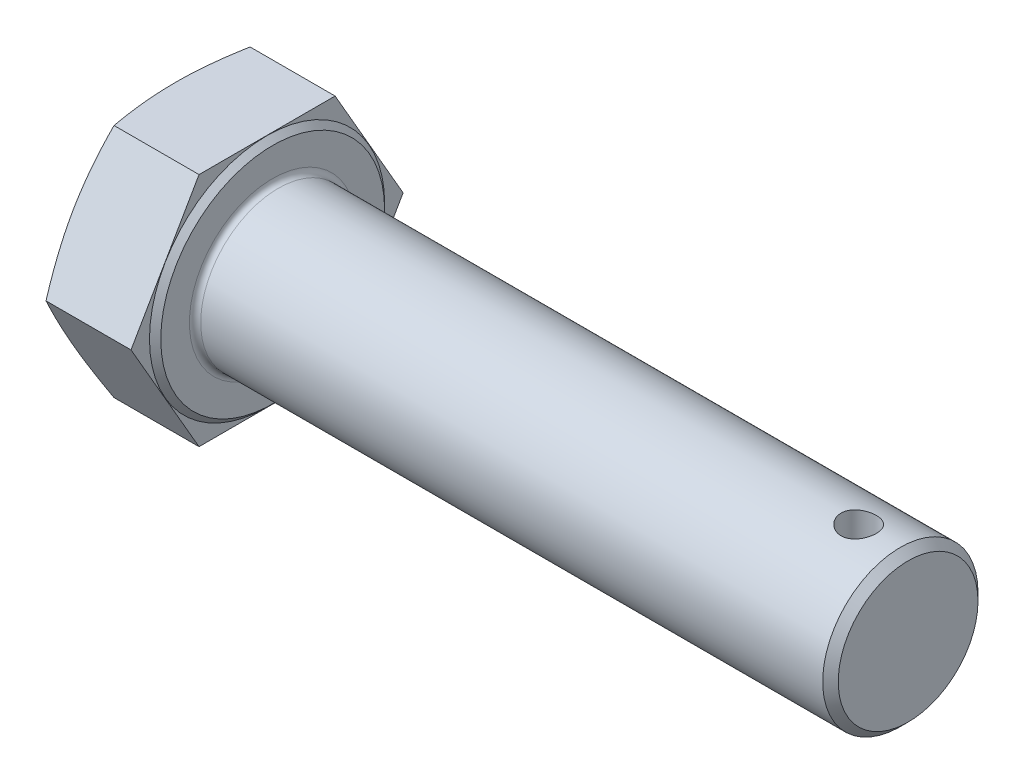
ISO-10303-21;
HEADER;
FILE_DESCRIPTION(('STEP AP214'),'2;1');
FILE_NAME('part.step','',(''),(''),'','','');
FILE_SCHEMA(('AUTOMOTIVE_DESIGN { 1 0 10303 214 1 1 1 1 }'));
ENDSEC;
DATA;
#1=APPLICATION_CONTEXT('core data for automotive mechanical design processes');
#2=APPLICATION_PROTOCOL_DEFINITION('international standard','automotive_design',2000,#1);
#3=PRODUCT_CONTEXT('',#1,'mechanical');
#4=PRODUCT('Part','Part','',(#3));
#5=PRODUCT_RELATED_PRODUCT_CATEGORY('part','',(#4));
#6=PRODUCT_DEFINITION_FORMATION('','',#4);
#7=PRODUCT_DEFINITION_CONTEXT('part definition',#1,'design');
#8=PRODUCT_DEFINITION('design','',#6,#7);
#9=PRODUCT_DEFINITION_SHAPE('','',#8);
#10=(LENGTH_UNIT() NAMED_UNIT(*) SI_UNIT(.MILLI.,.METRE.));
#11=(NAMED_UNIT(*) PLANE_ANGLE_UNIT() SI_UNIT($,.RADIAN.));
#12=(NAMED_UNIT(*) SI_UNIT($,.STERADIAN.) SOLID_ANGLE_UNIT());
#13=UNCERTAINTY_MEASURE_WITH_UNIT(LENGTH_MEASURE(1.E-05),#10,'distance_accuracy_value','');
#14=(GEOMETRIC_REPRESENTATION_CONTEXT(3) GLOBAL_UNCERTAINTY_ASSIGNED_CONTEXT((#13)) GLOBAL_UNIT_ASSIGNED_CONTEXT((#10,
#11,#12)) REPRESENTATION_CONTEXT('',''));
#15=CARTESIAN_POINT('',(0.,0.,0.));
#16=DIRECTION('',(0.,0.,1.));
#17=DIRECTION('',(1.,0.,0.));
#18=AXIS2_PLACEMENT_3D('',#15,#16,#17);
#19=CARTESIAN_POINT('',(13.78,0.,-19.2719519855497));
#20=DIRECTION('',(1.,0.,0.));
#21=DIRECTION('',(0.,0.,-1.));
#22=AXIS2_PLACEMENT_3D('',#19,#20,#21);
#23=PLANE('',#22);
#24=CARTESIAN_POINT('',(13.78,0.,0.));
#25=DIRECTION('',(1.,0.,0.));
#26=DIRECTION('',(0.,0.,-1.));
#27=AXIS2_PLACEMENT_3D('',#24,#25,#26);
#28=CIRCLE('',#27,11.8);
#29=CARTESIAN_POINT('',(13.78,0.,-11.8));
#30=VERTEX_POINT('',#29);
#31=EDGE_CURVE('E11',#30,#30,#28,.F.);
#32=ORIENTED_EDGE('',*,*,#31,.T.);
#33=EDGE_LOOP('',(#32));
#34=FACE_BOUND('',#33,.T.);
#35=CARTESIAN_POINT('',(13.78,0.,0.));
#36=DIRECTION('',(-1.,0.,0.));
#37=DIRECTION('',(0.,0.,1.));
#38=AXIS2_PLACEMENT_3D('',#35,#36,#37);
#39=CIRCLE('',#38,15.855);
#40=CARTESIAN_POINT('',(13.78,0.,15.855));
#41=VERTEX_POINT('',#40);
#42=EDGE_CURVE('E381',#41,#41,#39,.T.);
#43=ORIENTED_EDGE('',*,*,#42,.F.);
#44=EDGE_LOOP('',(#43));
#45=FACE_BOUND('',#44,.T.);
#46=ADVANCED_FACE('F32',(#34,#45),#23,.T.);
#47=CARTESIAN_POINT('',(13.78,-16.69,-9.63597599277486));
#48=DIRECTION('',(0.,0.5,0.866025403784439));
#49=DIRECTION('',(0.,-0.866025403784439,0.5));
#50=AXIS2_PLACEMENT_3D('',#47,#48,#49);
#51=PLANE('',#50);
#52=CARTESIAN_POINT('',(0.939795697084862,0.000200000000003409,-19.2720674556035));
#53=CARTESIAN_POINT('',(0.867168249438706,-0.345441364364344,-19.0725113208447));
#54=CARTESIAN_POINT('',(0.797807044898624,-0.691590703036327,-18.8726619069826));
#55=CARTESIAN_POINT('',(0.666335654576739,-1.38495249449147,-18.4723492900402));
#56=CARTESIAN_POINT('',(0.604226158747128,-1.7321650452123,-18.2718860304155));
#57=CARTESIAN_POINT('',(0.429792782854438,-2.7758502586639,-17.66931409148));
#58=CARTESIAN_POINT('',(0.329466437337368,-3.47389266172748,-17.2662991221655));
#59=CARTESIAN_POINT('',(0.207537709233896,-4.52008028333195,-16.6622824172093));
#60=CARTESIAN_POINT('',(0.1717582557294,-4.86701845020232,-16.4619775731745));
#61=CARTESIAN_POINT('',(0.109969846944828,-5.56154255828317,-16.0609938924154));
#62=CARTESIAN_POINT('',(0.0839604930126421,-5.90912847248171,-15.8603150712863));
#63=CARTESIAN_POINT('',(0.0421666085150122,-6.60464256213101,-15.4587598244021));
#64=CARTESIAN_POINT('',(0.0263785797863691,-6.95257057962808,-15.2578834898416));
#65=CARTESIAN_POINT('',(0.00529529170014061,-7.64866573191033,-14.8559927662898));
#66=CARTESIAN_POINT('',(0.,-7.99683286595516,-14.6549783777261));
#67=CARTESIAN_POINT('',(0.,-8.69316713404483,-14.2529496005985));
#68=CARTESIAN_POINT('',(0.00529529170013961,-9.04133426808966,-14.0519352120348));
#69=CARTESIAN_POINT('',(0.0263785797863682,-9.73742942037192,-13.650044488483));
#70=CARTESIAN_POINT('',(0.0421666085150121,-10.085357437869,-13.4491681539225));
#71=CARTESIAN_POINT('',(0.0839604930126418,-10.7808715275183,-13.0476129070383));
#72=CARTESIAN_POINT('',(0.109969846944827,-11.1284574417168,-12.8469340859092));
#73=CARTESIAN_POINT('',(0.171758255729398,-11.8229815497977,-12.44595040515));
#74=CARTESIAN_POINT('',(0.207537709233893,-12.169919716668,-12.2456455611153));
#75=CARTESIAN_POINT('',(0.329466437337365,-13.2161073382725,-11.6416288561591));
#76=CARTESIAN_POINT('',(0.429792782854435,-13.9141497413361,-11.2386138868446));
#77=CARTESIAN_POINT('',(0.604226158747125,-14.9578349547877,-10.636041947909));
#78=CARTESIAN_POINT('',(0.666335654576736,-15.3050475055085,-10.4355786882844));
#79=CARTESIAN_POINT('',(0.797807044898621,-15.9984092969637,-10.0352660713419));
#80=CARTESIAN_POINT('',(0.867168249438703,-16.3445586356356,-9.83541665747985));
#81=CARTESIAN_POINT('',(0.93979569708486,-16.6902,-9.63586052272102));
#82=B_SPLINE_CURVE_WITH_KNOTS('',3,(#52,#53,#54,#55,#56,#57,#58,#59,#60,#61,#62,#63,#64,#65,#66,
#67,#68,#69,#70,#71,#72,#73,#74,#75,#76,#77,#78,#79,#80,#81),.UNSPECIFIED.,.F.,.F.,(4,2,2,2,2,2,
2,2,2,2,2,2,2,2,4),(0.,1.21696349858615,2.43404268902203,4.86988356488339,6.07640128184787,
7.28286976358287,8.4889251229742,9.69497676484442,10.9010284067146,12.107083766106,
13.313552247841,14.5200699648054,16.9559108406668,18.1729900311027,19.3899535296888),.UNSPECIFIED.);
#83=CARTESIAN_POINT('',(0.939753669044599,0.,-19.2719519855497));
#84=VERTEX_POINT('',#83);
#85=CARTESIAN_POINT('',(0.,-8.345,-14.4539639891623));
#86=VERTEX_POINT('',#85);
#87=EDGE_CURVE('E111',#84,#86,#82,.T.);
#88=ORIENTED_EDGE('',*,*,#87,.F.);
#89=DIRECTION('',(-1.,0.,0.));
#90=VECTOR('',#89,1.);
#91=CARTESIAN_POINT('',(13.78,0.,-19.2719519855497));
#92=LINE('',#91,#90);
#93=CARTESIAN_POINT('',(12.98,0.,-19.2719519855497));
#94=VERTEX_POINT('',#93);
#95=EDGE_CURVE('E140',#94,#84,#92,.T.);
#96=ORIENTED_EDGE('',*,*,#95,.F.);
#97=DIRECTION('',(0.,0.866025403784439,-0.5));
#98=VECTOR('',#97,1.);
#99=CARTESIAN_POINT('',(12.98,-16.69,-9.63597599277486));
#100=LINE('',#99,#98);
#101=CARTESIAN_POINT('',(12.98,-16.69,-9.63597599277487));
#102=VERTEX_POINT('',#101);
#103=EDGE_CURVE('E396',#102,#94,#100,.T.);
#104=ORIENTED_EDGE('',*,*,#103,.F.);
#105=DIRECTION('',(-1.,0.,0.));
#106=VECTOR('',#105,1.);
#107=CARTESIAN_POINT('',(13.78,-16.69,-9.63597599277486));
#108=LINE('',#107,#106);
#109=CARTESIAN_POINT('',(0.939753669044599,-16.69,-9.63597599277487));
#110=VERTEX_POINT('',#109);
#111=EDGE_CURVE('E134',#102,#110,#108,.T.);
#112=ORIENTED_EDGE('',*,*,#111,.T.);
#113=EDGE_CURVE('E234',#86,#110,#82,.T.);
#114=ORIENTED_EDGE('',*,*,#113,.F.);
#115=EDGE_LOOP('',(#88,#96,#104,#112,#114));
#116=FACE_BOUND('',#115,.T.);
#117=ADVANCED_FACE('F34',(#116),#51,.F.);
#118=CARTESIAN_POINT('',(13.78,0.,-19.2719519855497));
#119=DIRECTION('',(0.,-0.5,0.866025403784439));
#120=DIRECTION('',(0.,-0.866025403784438,-0.5));
#121=AXIS2_PLACEMENT_3D('',#118,#119,#120);
#122=PLANE('',#121);
#123=CARTESIAN_POINT('',(0.93979569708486,16.6902,-9.63586052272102));
#124=CARTESIAN_POINT('',(0.867168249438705,16.3445586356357,-9.83541665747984));
#125=CARTESIAN_POINT('',(0.797807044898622,15.9984092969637,-10.0352660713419));
#126=CARTESIAN_POINT('',(0.666335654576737,15.3050475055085,-10.4355786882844));
#127=CARTESIAN_POINT('',(0.604226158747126,14.9578349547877,-10.636041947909));
#128=CARTESIAN_POINT('',(0.429792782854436,13.9141497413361,-11.2386138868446));
#129=CARTESIAN_POINT('',(0.329466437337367,13.2161073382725,-11.6416288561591));
#130=CARTESIAN_POINT('',(0.207537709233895,12.169919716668,-12.2456455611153));
#131=CARTESIAN_POINT('',(0.171758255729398,11.8229815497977,-12.44595040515));
#132=CARTESIAN_POINT('',(0.109969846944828,11.1284574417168,-12.8469340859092));
#133=CARTESIAN_POINT('',(0.0839604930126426,10.7808715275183,-13.0476129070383));
#134=CARTESIAN_POINT('',(0.042166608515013,10.085357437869,-13.4491681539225));
#135=CARTESIAN_POINT('',(0.026378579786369,9.73742942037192,-13.650044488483));
#136=CARTESIAN_POINT('',(0.0052952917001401,9.04133426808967,-14.0519352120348));
#137=CARTESIAN_POINT('',(0.,8.69316713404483,-14.2529496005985));
#138=CARTESIAN_POINT('',(0.,7.99683286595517,-14.654978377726));
#139=CARTESIAN_POINT('',(0.00529529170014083,7.64866573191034,-14.8559927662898));
#140=CARTESIAN_POINT('',(0.0263785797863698,6.95257057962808,-15.2578834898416));
#141=CARTESIAN_POINT('',(0.0421666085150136,6.60464256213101,-15.4587598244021));
#142=CARTESIAN_POINT('',(0.0839604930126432,5.90912847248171,-15.8603150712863));
#143=CARTESIAN_POINT('',(0.109969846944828,5.56154255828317,-16.0609938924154));
#144=CARTESIAN_POINT('',(0.171758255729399,4.86701845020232,-16.4619775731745));
#145=CARTESIAN_POINT('',(0.207537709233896,4.52008028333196,-16.6622824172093));
#146=CARTESIAN_POINT('',(0.329466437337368,3.47389266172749,-17.2662991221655));
#147=CARTESIAN_POINT('',(0.429792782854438,2.77585025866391,-17.66931409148));
#148=CARTESIAN_POINT('',(0.604226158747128,1.73216504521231,-18.2718860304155));
#149=CARTESIAN_POINT('',(0.666335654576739,1.38495249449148,-18.4723492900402));
#150=CARTESIAN_POINT('',(0.797807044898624,0.691590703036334,-18.8726619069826));
#151=CARTESIAN_POINT('',(0.867168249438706,0.345441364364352,-19.0725113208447));
#152=CARTESIAN_POINT('',(0.939795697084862,-0.000199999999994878,-19.2720674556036));
#153=B_SPLINE_CURVE_WITH_KNOTS('',3,(#123,#124,#125,#126,#127,#128,#129,#130,#131,#132,#133,
#134,#135,#136,#137,#138,#139,#140,#141,#142,#143,#144,#145,#146,#147,#148,#149,#150,#151,#152),
.UNSPECIFIED.,.F.,.F.,(4,2,2,2,2,2,2,2,2,2,2,2,2,2,4),(0.,1.21696349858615,2.43404268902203,
4.86988356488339,6.07640128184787,7.28286976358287,8.4889251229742,9.69497676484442,
10.9010284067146,12.107083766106,13.313552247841,14.5200699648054,16.9559108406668,
18.1729900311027,19.3899535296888),.UNSPECIFIED.);
#154=CARTESIAN_POINT('',(0.939753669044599,16.69,-9.63597599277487));
#155=VERTEX_POINT('',#154);
#156=CARTESIAN_POINT('',(0.,8.34500000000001,-14.4539639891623));
#157=VERTEX_POINT('',#156);
#158=EDGE_CURVE('E245',#155,#157,#153,.T.);
#159=ORIENTED_EDGE('',*,*,#158,.F.);
#160=DIRECTION('',(-1.,0.,0.));
#161=VECTOR('',#160,1.);
#162=CARTESIAN_POINT('',(13.78,16.69,-9.63597599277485));
#163=LINE('',#162,#161);
#164=CARTESIAN_POINT('',(12.98,16.69,-9.63597599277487));
#165=VERTEX_POINT('',#164);
#166=EDGE_CURVE('E131',#165,#155,#163,.T.);
#167=ORIENTED_EDGE('',*,*,#166,.F.);
#168=DIRECTION('',(0.,0.866025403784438,0.5));
#169=VECTOR('',#168,1.);
#170=CARTESIAN_POINT('',(12.98,0.,-19.2719519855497));
#171=LINE('',#170,#169);
#172=EDGE_CURVE('E398',#94,#165,#171,.T.);
#173=ORIENTED_EDGE('',*,*,#172,.F.);
#174=ORIENTED_EDGE('',*,*,#95,.T.);
#175=EDGE_CURVE('E122',#157,#84,#153,.T.);
#176=ORIENTED_EDGE('',*,*,#175,.F.);
#177=EDGE_LOOP('',(#159,#167,#173,#174,#176));
#178=FACE_BOUND('',#177,.T.);
#179=ADVANCED_FACE('F195',(#178),#122,.F.);
#180=CARTESIAN_POINT('',(13.78,16.69,-9.63597599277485));
#181=DIRECTION('',(0.,-1.,0.));
#182=DIRECTION('',(0.,0.,-1.));
#183=AXIS2_PLACEMENT_3D('',#180,#181,#182);
#184=PLANE('',#183);
#185=CARTESIAN_POINT('',(5.02167092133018,16.69,-25.5126761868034));
#186=CARTESIAN_POINT('',(4.90667655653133,16.69,-25.135123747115));
#187=CARTESIAN_POINT('',(4.79237762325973,16.69,-24.7573596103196));
#188=CARTESIAN_POINT('',(4.56532630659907,16.69,-24.001364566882));
#189=CARTESIAN_POINT('',(4.45257393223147,16.69,-23.623133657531));
#190=CARTESIAN_POINT('',(4.11685563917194,16.69,-22.4876263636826));
#191=CARTESIAN_POINT('',(3.89644559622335,16.69,-21.7295912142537));
#192=CARTESIAN_POINT('',(3.46360774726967,16.69,-20.2097103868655));
#193=CARTESIAN_POINT('',(3.25119560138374,16.69,-19.4478602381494));
#194=CARTESIAN_POINT('',(2.83682211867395,16.69,-17.9213263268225));
#195=CARTESIAN_POINT('',(2.63486059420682,16.69,-17.1566426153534));
#196=CARTESIAN_POINT('',(2.24639209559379,16.69,-15.6333807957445));
#197=CARTESIAN_POINT('',(2.0597252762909,16.69,-14.8748436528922));
#198=CARTESIAN_POINT('',(1.70228382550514,16.69,-13.3539948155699));
#199=CARTESIAN_POINT('',(1.53150946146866,16.69,-12.5916830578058));
#200=CARTESIAN_POINT('',(1.20983471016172,16.69,-11.0631143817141));
#201=CARTESIAN_POINT('',(1.05892754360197,16.69,-10.2968589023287));
#202=CARTESIAN_POINT('',(0.781582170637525,16.69,-8.75989930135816));
#203=CARTESIAN_POINT('',(0.655143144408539,16.69,-7.98919532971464));
#204=CARTESIAN_POINT('',(0.444389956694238,16.69,-6.53012303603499));
#205=CARTESIAN_POINT('',(0.356942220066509,16.69,-5.84221159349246));
#206=CARTESIAN_POINT('',(0.208914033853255,16.69,-4.46347987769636));
#207=CARTESIAN_POINT('',(0.14833280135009,16.69,-3.77265968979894));
#208=CARTESIAN_POINT('',(0.0569550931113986,16.69,-2.38951172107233));
#209=CARTESIAN_POINT('',(0.0261375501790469,16.69,-1.69718535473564));
#210=CARTESIAN_POINT('',(-0.004152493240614,16.69,-0.311839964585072));
#211=CARTESIAN_POINT('',(-0.00362521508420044,16.69,0.381179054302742));
#212=CARTESIAN_POINT('',(0.0288278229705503,16.69,1.76998588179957));
#213=CARTESIAN_POINT('',(0.060912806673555,16.69,2.46576990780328));
#214=CARTESIAN_POINT('',(0.155004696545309,16.69,3.85529426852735));
#215=CARTESIAN_POINT('',(0.217012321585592,16.69,4.54903455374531));
#216=CARTESIAN_POINT('',(0.368048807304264,16.69,5.93412887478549));
#217=CARTESIAN_POINT('',(0.457100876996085,16.69,6.62548034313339));
#218=CARTESIAN_POINT('',(0.658614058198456,16.69,8.00472461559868));
#219=CARTESIAN_POINT('',(0.771075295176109,16.69,8.69261740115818));
#220=CARTESIAN_POINT('',(1.02221809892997,16.69,10.1011424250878));
#221=CARTESIAN_POINT('',(1.16197193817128,16.69,10.8215817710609));
#222=CARTESIAN_POINT('',(1.45946676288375,16.69,12.2587608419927));
#223=CARTESIAN_POINT('',(1.61720910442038,16.69,12.9755002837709));
#224=CARTESIAN_POINT('',(1.94736866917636,16.69,14.4057902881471));
#225=CARTESIAN_POINT('',(2.11979015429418,16.69,15.1193398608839));
#226=CARTESIAN_POINT('',(2.47650321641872,16.69,16.5434331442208));
#227=CARTESIAN_POINT('',(2.66079450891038,16.69,17.2539769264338));
#228=CARTESIAN_POINT('',(3.03927131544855,16.69,18.6733925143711));
#229=CARTESIAN_POINT('',(3.23346923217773,16.69,19.3822610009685));
#230=CARTESIAN_POINT('',(3.62976485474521,16.69,20.797783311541));
#231=CARTESIAN_POINT('',(3.83186259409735,16.69,21.504437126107));
#232=CARTESIAN_POINT('',(4.2425118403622,16.69,22.9157343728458));
#233=CARTESIAN_POINT('',(4.45106225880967,16.69,23.620378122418));
#234=CARTESIAN_POINT('',(4.87352836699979,16.69,25.0280510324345));
#235=CARTESIAN_POINT('',(5.08744404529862,16.69,25.7310801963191));
#236=CARTESIAN_POINT('',(5.5173589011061,16.69,27.1280057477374));
#237=CARTESIAN_POINT('',(5.73330899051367,16.69,27.8219172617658));
#238=CARTESIAN_POINT('',(6.16889244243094,16.69,29.2085840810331));
#239=CARTESIAN_POINT('',(6.38852581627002,16.69,29.9013393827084));
#240=CARTESIAN_POINT('',(7.05209604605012,16.69,31.9781794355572));
#241=CARTESIAN_POINT('',(7.50068453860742,16.69,33.3607786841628));
#242=CARTESIAN_POINT('',(8.17950228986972,16.69,35.4298173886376));
#243=CARTESIAN_POINT('',(8.40632573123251,16.69,36.1173799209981));
#244=CARTESIAN_POINT('',(8.86193435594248,16.69,37.4918557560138));
#245=CARTESIAN_POINT('',(9.09071954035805,16.69,38.1787690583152));
#246=CARTESIAN_POINT('',(9.54996937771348,16.69,39.5519709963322));
#247=CARTESIAN_POINT('',(9.78043389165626,16.69,40.2382596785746));
#248=CARTESIAN_POINT('',(10.2428541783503,16.69,41.6103326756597));
#249=CARTESIAN_POINT('',(10.4748099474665,16.69,42.2961169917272));
#250=CARTESIAN_POINT('',(10.7074085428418,16.69,42.9816827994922));
#251=B_SPLINE_CURVE_WITH_KNOTS('',3,(#185,#186,#187,#188,#189,#190,#191,#192,#193,#194,#195,
#196,#197,#198,#199,#200,#201,#202,#203,#204,#205,#206,#207,#208,#209,#210,#211,#212,#213,#214,
#215,#216,#217,#218,#219,#220,#221,#222,#223,#224,#225,#226,#227,#228,#229,#230,#231,#232,#233,
#234,#235,#236,#237,#238,#239,#240,#241,#242,#243,#244,#245,#246,#247,#248,#249,#250),
.UNSPECIFIED.,.F.,.F.,(4,2,2,2,2,2,2,2,2,2,2,2,2,2,2,2,2,2,2,2,2,2,2,2,2,2,2,2,2,2,2,2,4),(0.,
1.18402827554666,2.36806345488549,4.7363088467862,7.10897279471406,9.48159412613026,
11.8249622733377,14.1683698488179,16.5109756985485,18.8535030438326,20.9333884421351,
23.0132132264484,25.0915647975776,27.1699016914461,29.2587788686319,31.3477062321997,
33.4384313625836,35.5291676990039,37.7304937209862,39.9319858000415,42.134119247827,
44.3361999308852,46.5411086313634,48.746026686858,50.9505748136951,53.1551182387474,
55.335319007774,57.5155264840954,61.8761287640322,64.0481587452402,66.2201899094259,
68.3920432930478,70.5638913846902),.UNSPECIFIED.);
#252=CARTESIAN_POINT('',(0.939753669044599,16.69,9.63597599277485));
#253=VERTEX_POINT('',#252);
#254=CARTESIAN_POINT('',(0.,16.69,0.));
#255=VERTEX_POINT('',#254);
#256=EDGE_CURVE('E48',#253,#255,#251,.F.);
#257=ORIENTED_EDGE('',*,*,#256,.F.);
#258=DIRECTION('',(-1.,0.,0.));
#259=VECTOR('',#258,1.);
#260=CARTESIAN_POINT('',(13.78,16.69,9.63597599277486));
#261=LINE('',#260,#259);
#262=CARTESIAN_POINT('',(12.98,16.69,9.63597599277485));
#263=VERTEX_POINT('',#262);
#264=EDGE_CURVE('E128',#263,#253,#261,.T.);
#265=ORIENTED_EDGE('',*,*,#264,.F.);
#266=DIRECTION('',(0.,0.,1.));
#267=VECTOR('',#266,1.);
#268=CARTESIAN_POINT('',(12.98,16.69,-9.63597599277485));
#269=LINE('',#268,#267);
#270=EDGE_CURVE('E400',#165,#263,#269,.T.);
#271=ORIENTED_EDGE('',*,*,#270,.F.);
#272=ORIENTED_EDGE('',*,*,#166,.T.);
#273=EDGE_CURVE('E246',#255,#155,#251,.F.);
#274=ORIENTED_EDGE('',*,*,#273,.F.);
#275=EDGE_LOOP('',(#257,#265,#271,#272,#274));
#276=FACE_BOUND('',#275,.T.);
#277=ADVANCED_FACE('F254',(#276),#184,.F.);
#278=CARTESIAN_POINT('',(13.78,16.69,9.63597599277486));
#279=DIRECTION('',(0.,-0.5,-0.866025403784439));
#280=DIRECTION('',(0.,0.866025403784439,-0.5));
#281=AXIS2_PLACEMENT_3D('',#278,#279,#280);
#282=PLANE('',#281);
#283=CARTESIAN_POINT('',(0.939795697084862,-0.0001999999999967,19.2720674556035));
#284=CARTESIAN_POINT('',(0.867168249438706,0.345441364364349,19.0725113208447));
#285=CARTESIAN_POINT('',(0.797807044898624,0.691590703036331,18.8726619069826));
#286=CARTESIAN_POINT('',(0.666335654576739,1.38495249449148,18.4723492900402));
#287=CARTESIAN_POINT('',(0.604226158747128,1.73216504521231,18.2718860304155));
#288=CARTESIAN_POINT('',(0.429792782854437,2.77585025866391,17.66931409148));
#289=CARTESIAN_POINT('',(0.329466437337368,3.47389266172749,17.2662991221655));
#290=CARTESIAN_POINT('',(0.207537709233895,4.52008028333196,16.6622824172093));
#291=CARTESIAN_POINT('',(0.171758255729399,4.86701845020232,16.4619775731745));
#292=CARTESIAN_POINT('',(0.109969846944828,5.56154255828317,16.0609938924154));
#293=CARTESIAN_POINT('',(0.0839604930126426,5.90912847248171,15.8603150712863));
#294=CARTESIAN_POINT('',(0.042166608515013,6.60464256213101,15.4587598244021));
#295=CARTESIAN_POINT('',(0.0263785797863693,6.95257057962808,15.2578834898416));
#296=CARTESIAN_POINT('',(0.00529529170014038,7.64866573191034,14.8559927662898));
#297=CARTESIAN_POINT('',(0.,7.99683286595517,14.654978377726));
#298=CARTESIAN_POINT('',(0.,8.69316713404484,14.2529496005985));
#299=CARTESIAN_POINT('',(0.00529529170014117,9.04133426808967,14.0519352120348));
#300=CARTESIAN_POINT('',(0.0263785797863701,9.73742942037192,13.650044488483));
#301=CARTESIAN_POINT('',(0.0421666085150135,10.085357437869,13.4491681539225));
#302=CARTESIAN_POINT('',(0.0839604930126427,10.7808715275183,13.0476129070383));
#303=CARTESIAN_POINT('',(0.109969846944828,11.1284574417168,12.8469340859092));
#304=CARTESIAN_POINT('',(0.171758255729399,11.8229815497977,12.44595040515));
#305=CARTESIAN_POINT('',(0.207537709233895,12.1699197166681,12.2456455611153));
#306=CARTESIAN_POINT('',(0.329466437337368,13.2161073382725,11.6416288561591));
#307=CARTESIAN_POINT('',(0.429792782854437,13.9141497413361,11.2386138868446));
#308=CARTESIAN_POINT('',(0.604226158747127,14.9578349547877,10.636041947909));
#309=CARTESIAN_POINT('',(0.666335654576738,15.3050475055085,10.4355786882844));
#310=CARTESIAN_POINT('',(0.797807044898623,15.9984092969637,10.0352660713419));
#311=CARTESIAN_POINT('',(0.867168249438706,16.3445586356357,9.83541665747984));
#312=CARTESIAN_POINT('',(0.939795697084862,16.6902,9.63586052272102));
#313=B_SPLINE_CURVE_WITH_KNOTS('',3,(#283,#284,#285,#286,#287,#288,#289,#290,#291,#292,#293,
#294,#295,#296,#297,#298,#299,#300,#301,#302,#303,#304,#305,#306,#307,#308,#309,#310,#311,#312),
.UNSPECIFIED.,.F.,.F.,(4,2,2,2,2,2,2,2,2,2,2,2,2,2,4),(0.,1.21696349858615,2.43404268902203,
4.86988356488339,6.07640128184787,7.28286976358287,8.4889251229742,9.69497676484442,
10.9010284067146,12.107083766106,13.313552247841,14.5200699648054,16.9559108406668,
18.1729900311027,19.3899535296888),.UNSPECIFIED.);
#314=CARTESIAN_POINT('',(0.939753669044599,0.,19.2719519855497));
#315=VERTEX_POINT('',#314);
#316=CARTESIAN_POINT('',(0.,8.345,14.4539639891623));
#317=VERTEX_POINT('',#316);
#318=EDGE_CURVE('E56',#315,#317,#313,.T.);
#319=ORIENTED_EDGE('',*,*,#318,.F.);
#320=DIRECTION('',(-1.,0.,0.));
#321=VECTOR('',#320,1.);
#322=CARTESIAN_POINT('',(13.78,0.,19.2719519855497));
#323=LINE('',#322,#321);
#324=CARTESIAN_POINT('',(12.98,0.,19.2719519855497));
#325=VERTEX_POINT('',#324);
#326=EDGE_CURVE('E119',#325,#315,#323,.T.);
#327=ORIENTED_EDGE('',*,*,#326,.F.);
#328=DIRECTION('',(0.,-0.866025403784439,0.5));
#329=VECTOR('',#328,1.);
#330=CARTESIAN_POINT('',(12.98,16.69,9.63597599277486));
#331=LINE('',#330,#329);
#332=EDGE_CURVE('E404',#263,#325,#331,.T.);
#333=ORIENTED_EDGE('',*,*,#332,.F.);
#334=ORIENTED_EDGE('',*,*,#264,.T.);
#335=EDGE_CURVE('E121',#317,#253,#313,.T.);
#336=ORIENTED_EDGE('',*,*,#335,.F.);
#337=EDGE_LOOP('',(#319,#327,#333,#334,#336));
#338=FACE_BOUND('',#337,.T.);
#339=ADVANCED_FACE('F117',(#338),#282,.F.);
#340=CARTESIAN_POINT('',(13.78,0.,19.2719519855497));
#341=DIRECTION('',(0.,0.5,-0.866025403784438));
#342=DIRECTION('',(0.,0.866025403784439,0.5));
#343=AXIS2_PLACEMENT_3D('',#340,#341,#342);
#344=PLANE('',#343);
#345=CARTESIAN_POINT('',(0.939795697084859,-16.6902,9.63586052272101));
#346=CARTESIAN_POINT('',(0.867168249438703,-16.3445586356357,9.83541665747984));
#347=CARTESIAN_POINT('',(0.797807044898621,-15.9984092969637,10.0352660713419));
#348=CARTESIAN_POINT('',(0.666335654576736,-15.3050475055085,10.4355786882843));
#349=CARTESIAN_POINT('',(0.604226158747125,-14.9578349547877,10.636041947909));
#350=CARTESIAN_POINT('',(0.429792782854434,-13.9141497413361,11.2386138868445));
#351=CARTESIAN_POINT('',(0.329466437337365,-13.2161073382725,11.6416288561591));
#352=CARTESIAN_POINT('',(0.207537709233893,-12.169919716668,12.2456455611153));
#353=CARTESIAN_POINT('',(0.171758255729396,-11.8229815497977,12.44595040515));
#354=CARTESIAN_POINT('',(0.109969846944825,-11.1284574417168,12.8469340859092));
#355=CARTESIAN_POINT('',(0.0839604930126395,-10.7808715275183,13.0476129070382));
#356=CARTESIAN_POINT('',(0.0421666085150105,-10.085357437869,13.4491681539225));
#357=CARTESIAN_POINT('',(0.0263785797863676,-9.73742942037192,13.650044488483));
#358=CARTESIAN_POINT('',(0.00529529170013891,-9.04133426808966,14.0519352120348));
#359=CARTESIAN_POINT('',(0.,-8.69316713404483,14.2529496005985));
#360=CARTESIAN_POINT('',(0.,-7.99683286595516,14.654978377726));
#361=CARTESIAN_POINT('',(0.00529529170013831,-7.64866573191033,14.8559927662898));
#362=CARTESIAN_POINT('',(0.0263785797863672,-6.95257057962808,15.2578834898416));
#363=CARTESIAN_POINT('',(0.0421666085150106,-6.60464256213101,15.4587598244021));
#364=CARTESIAN_POINT('',(0.0839604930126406,-5.90912847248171,15.8603150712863));
#365=CARTESIAN_POINT('',(0.109969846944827,-5.56154255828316,16.0609938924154));
#366=CARTESIAN_POINT('',(0.171758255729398,-4.86701845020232,16.4619775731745));
#367=CARTESIAN_POINT('',(0.207537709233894,-4.52008028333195,16.6622824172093));
#368=CARTESIAN_POINT('',(0.329466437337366,-3.47389266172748,17.2662991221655));
#369=CARTESIAN_POINT('',(0.429792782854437,-2.7758502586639,17.66931409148));
#370=CARTESIAN_POINT('',(0.604226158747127,-1.7321650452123,18.2718860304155));
#371=CARTESIAN_POINT('',(0.666335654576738,-1.38495249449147,18.4723492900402));
#372=CARTESIAN_POINT('',(0.797807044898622,-0.691590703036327,18.8726619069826));
#373=CARTESIAN_POINT('',(0.867168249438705,-0.345441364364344,19.0725113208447));
#374=CARTESIAN_POINT('',(0.939795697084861,0.000200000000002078,19.2720674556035));
#375=B_SPLINE_CURVE_WITH_KNOTS('',3,(#345,#346,#347,#348,#349,#350,#351,#352,#353,#354,#355,
#356,#357,#358,#359,#360,#361,#362,#363,#364,#365,#366,#367,#368,#369,#370,#371,#372,#373,#374),
.UNSPECIFIED.,.F.,.F.,(4,2,2,2,2,2,2,2,2,2,2,2,2,2,4),(0.,1.21696349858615,2.43404268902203,
4.86988356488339,6.07640128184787,7.28286976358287,8.4889251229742,9.69497676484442,
10.9010284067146,12.107083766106,13.313552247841,14.5200699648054,16.9559108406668,
18.1729900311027,19.3899535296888),.UNSPECIFIED.);
#376=CARTESIAN_POINT('',(0.939753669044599,-16.69,9.63597599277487));
#377=VERTEX_POINT('',#376);
#378=CARTESIAN_POINT('',(0.,-8.34500000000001,14.4539639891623));
#379=VERTEX_POINT('',#378);
#380=EDGE_CURVE('E113',#377,#379,#375,.T.);
#381=ORIENTED_EDGE('',*,*,#380,.F.);
#382=DIRECTION('',(-1.,0.,0.));
#383=VECTOR('',#382,1.);
#384=CARTESIAN_POINT('',(13.78,-16.69,9.63597599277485));
#385=LINE('',#384,#383);
#386=CARTESIAN_POINT('',(12.98,-16.69,9.63597599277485));
#387=VERTEX_POINT('',#386);
#388=EDGE_CURVE('E129',#387,#377,#385,.T.);
#389=ORIENTED_EDGE('',*,*,#388,.F.);
#390=DIRECTION('',(0.,-0.866025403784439,-0.5));
#391=VECTOR('',#390,1.);
#392=CARTESIAN_POINT('',(12.98,0.,19.2719519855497));
#393=LINE('',#392,#391);
#394=EDGE_CURVE('E127',#325,#387,#393,.T.);
#395=ORIENTED_EDGE('',*,*,#394,.F.);
#396=ORIENTED_EDGE('',*,*,#326,.T.);
#397=EDGE_CURVE('E103',#379,#315,#375,.T.);
#398=ORIENTED_EDGE('',*,*,#397,.F.);
#399=EDGE_LOOP('',(#381,#389,#395,#396,#398));
#400=FACE_BOUND('',#399,.T.);
#401=ADVANCED_FACE('F125',(#400),#344,.F.);
#402=CARTESIAN_POINT('',(13.78,-16.69,9.63597599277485));
#403=DIRECTION('',(0.,1.,0.));
#404=DIRECTION('',(0.,0.,1.));
#405=AXIS2_PLACEMENT_3D('',#402,#403,#404);
#406=PLANE('',#405);
#407=CARTESIAN_POINT('',(5.02167092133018,-16.69,-25.5126761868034));
#408=CARTESIAN_POINT('',(4.90667655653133,-16.69,-25.135123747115));
#409=CARTESIAN_POINT('',(4.79237762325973,-16.69,-24.7573596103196));
#410=CARTESIAN_POINT('',(4.56532630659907,-16.69,-24.0013645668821));
#411=CARTESIAN_POINT('',(4.45257393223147,-16.69,-23.623133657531));
#412=CARTESIAN_POINT('',(4.11685563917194,-16.69,-22.4876263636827));
#413=CARTESIAN_POINT('',(3.89644559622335,-16.69,-21.7295912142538));
#414=CARTESIAN_POINT('',(3.46360774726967,-16.69,-20.2097103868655));
#415=CARTESIAN_POINT('',(3.25119560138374,-16.69,-19.4478602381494));
#416=CARTESIAN_POINT('',(2.83682211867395,-16.69,-17.9213263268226));
#417=CARTESIAN_POINT('',(2.63486059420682,-16.69,-17.1566426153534));
#418=CARTESIAN_POINT('',(2.24639209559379,-16.69,-15.6333807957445));
#419=CARTESIAN_POINT('',(2.0597252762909,-16.69,-14.8748436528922));
#420=CARTESIAN_POINT('',(1.70228382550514,-16.69,-13.3539948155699));
#421=CARTESIAN_POINT('',(1.53150946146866,-16.69,-12.5916830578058));
#422=CARTESIAN_POINT('',(1.20983471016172,-16.69,-11.0631143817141));
#423=CARTESIAN_POINT('',(1.05892754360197,-16.69,-10.2968589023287));
#424=CARTESIAN_POINT('',(0.781582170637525,-16.69,-8.75989930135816));
#425=CARTESIAN_POINT('',(0.655143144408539,-16.69,-7.98919532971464));
#426=CARTESIAN_POINT('',(0.444389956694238,-16.69,-6.530123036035));
#427=CARTESIAN_POINT('',(0.356942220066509,-16.69,-5.84221159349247));
#428=CARTESIAN_POINT('',(0.208914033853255,-16.69,-4.46347987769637));
#429=CARTESIAN_POINT('',(0.14833280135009,-16.69,-3.77265968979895));
#430=CARTESIAN_POINT('',(0.0569550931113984,-16.69,-2.38951172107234));
#431=CARTESIAN_POINT('',(0.0261375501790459,-16.69,-1.69718535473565));
#432=CARTESIAN_POINT('',(-0.00415249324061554,-16.69,-0.311839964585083));
#433=CARTESIAN_POINT('',(-0.00362521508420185,-16.69,0.381179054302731));
#434=CARTESIAN_POINT('',(0.0288278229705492,-16.69,1.76998588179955));
#435=CARTESIAN_POINT('',(0.060912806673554,-16.69,2.46576990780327));
#436=CARTESIAN_POINT('',(0.155004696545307,-16.69,3.85529426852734));
#437=CARTESIAN_POINT('',(0.21701232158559,-16.69,4.5490345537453));
#438=CARTESIAN_POINT('',(0.368048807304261,-16.69,5.93412887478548));
#439=CARTESIAN_POINT('',(0.457100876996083,-16.69,6.62548034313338));
#440=CARTESIAN_POINT('',(0.658614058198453,-16.69,8.00472461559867));
#441=CARTESIAN_POINT('',(0.771075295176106,-16.69,8.69261740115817));
#442=CARTESIAN_POINT('',(1.02221809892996,-16.69,10.1011424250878));
#443=CARTESIAN_POINT('',(1.16197193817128,-16.69,10.8215817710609));
#444=CARTESIAN_POINT('',(1.45946676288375,-16.69,12.2587608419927));
#445=CARTESIAN_POINT('',(1.61720910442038,-16.69,12.9755002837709));
#446=CARTESIAN_POINT('',(1.94736866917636,-16.69,14.4057902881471));
#447=CARTESIAN_POINT('',(2.11979015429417,-16.69,15.1193398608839));
#448=CARTESIAN_POINT('',(2.47650321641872,-16.69,16.5434331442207));
#449=CARTESIAN_POINT('',(2.66079450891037,-16.69,17.2539769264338));
#450=CARTESIAN_POINT('',(3.03927131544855,-16.69,18.6733925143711));
#451=CARTESIAN_POINT('',(3.23346923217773,-16.69,19.3822610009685));
#452=CARTESIAN_POINT('',(3.62976485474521,-16.69,20.797783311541));
#453=CARTESIAN_POINT('',(3.83186259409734,-16.69,21.504437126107));
#454=CARTESIAN_POINT('',(4.2425118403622,-16.69,22.9157343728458));
#455=CARTESIAN_POINT('',(4.45106225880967,-16.69,23.620378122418));
#456=CARTESIAN_POINT('',(4.87352836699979,-16.69,25.0280510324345));
#457=CARTESIAN_POINT('',(5.08744404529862,-16.69,25.7310801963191));
#458=CARTESIAN_POINT('',(5.51735890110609,-16.69,27.1280057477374));
#459=CARTESIAN_POINT('',(5.73330899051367,-16.69,27.8219172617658));
#460=CARTESIAN_POINT('',(6.16889244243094,-16.69,29.2085840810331));
#461=CARTESIAN_POINT('',(6.38852581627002,-16.69,29.9013393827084));
#462=CARTESIAN_POINT('',(7.05209604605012,-16.69,31.9781794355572));
#463=CARTESIAN_POINT('',(7.50068453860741,-16.69,33.3607786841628));
#464=CARTESIAN_POINT('',(8.17950228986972,-16.69,35.4298173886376));
#465=CARTESIAN_POINT('',(8.4063257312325,-16.69,36.1173799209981));
#466=CARTESIAN_POINT('',(8.86193435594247,-16.69,37.4918557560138));
#467=CARTESIAN_POINT('',(9.09071954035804,-16.69,38.1787690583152));
#468=CARTESIAN_POINT('',(9.54996937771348,-16.69,39.5519709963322));
#469=CARTESIAN_POINT('',(9.78043389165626,-16.69,40.2382596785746));
#470=CARTESIAN_POINT('',(10.2428541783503,-16.69,41.6103326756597));
#471=CARTESIAN_POINT('',(10.4748099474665,-16.69,42.2961169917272));
#472=CARTESIAN_POINT('',(10.7074085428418,-16.69,42.9816827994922));
#473=B_SPLINE_CURVE_WITH_KNOTS('',3,(#407,#408,#409,#410,#411,#412,#413,#414,#415,#416,#417,
#418,#419,#420,#421,#422,#423,#424,#425,#426,#427,#428,#429,#430,#431,#432,#433,#434,#435,#436,
#437,#438,#439,#440,#441,#442,#443,#444,#445,#446,#447,#448,#449,#450,#451,#452,#453,#454,#455,
#456,#457,#458,#459,#460,#461,#462,#463,#464,#465,#466,#467,#468,#469,#470,#471,#472),
.UNSPECIFIED.,.F.,.F.,(4,2,2,2,2,2,2,2,2,2,2,2,2,2,2,2,2,2,2,2,2,2,2,2,2,2,2,2,2,2,2,2,4),(0.,
1.18402827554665,2.36806345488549,4.7363088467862,7.10897279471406,9.48159412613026,
11.8249622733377,14.1683698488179,16.5109756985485,18.8535030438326,20.9333884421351,
23.0132132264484,25.0915647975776,27.169901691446,29.2587788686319,31.3477062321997,
33.4384313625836,35.5291676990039,37.7304937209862,39.9319858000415,42.134119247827,
44.3361999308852,46.5411086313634,48.746026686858,50.9505748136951,53.1551182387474,
55.335319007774,57.5155264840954,61.8761287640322,64.0481587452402,66.2201899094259,
68.3920432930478,70.5638913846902),.UNSPECIFIED.);
#474=CARTESIAN_POINT('',(0.,-16.69,0.));
#475=VERTEX_POINT('',#474);
#476=EDGE_CURVE('E215',#110,#475,#473,.T.);
#477=ORIENTED_EDGE('',*,*,#476,.F.);
#478=ORIENTED_EDGE('',*,*,#111,.F.);
#479=DIRECTION('',(0.,0.,-1.));
#480=VECTOR('',#479,1.);
#481=CARTESIAN_POINT('',(12.98,-16.69,9.63597599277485));
#482=LINE('',#481,#480);
#483=EDGE_CURVE('E143',#387,#102,#482,.T.);
#484=ORIENTED_EDGE('',*,*,#483,.F.);
#485=ORIENTED_EDGE('',*,*,#388,.T.);
#486=EDGE_CURVE('E210',#475,#377,#473,.T.);
#487=ORIENTED_EDGE('',*,*,#486,.F.);
#488=EDGE_LOOP('',(#477,#478,#484,#485,#487));
#489=FACE_BOUND('',#488,.T.);
#490=ADVANCED_FACE('F201',(#489),#406,.F.);
#491=CARTESIAN_POINT('',(12.98,0.,-16.655));
#492=DIRECTION('',(1.,0.,0.));
#493=DIRECTION('',(0.,0.,-1.));
#494=AXIS2_PLACEMENT_3D('',#491,#492,#493);
#495=PLANE('',#494);
#496=CARTESIAN_POINT('',(12.98,0.,0.));
#497=DIRECTION('',(-1.,0.,0.));
#498=DIRECTION('',(0.,0.,1.));
#499=AXIS2_PLACEMENT_3D('',#496,#497,#498);
#500=CIRCLE('',#499,16.655);
#501=CARTESIAN_POINT('',(12.98,0.,16.655));
#502=VERTEX_POINT('',#501);
#503=EDGE_CURVE('E407',#502,#502,#500,.T.);
#504=ORIENTED_EDGE('',*,*,#503,.T.);
#505=EDGE_LOOP('',(#504));
#506=FACE_BOUND('',#505,.T.);
#507=ORIENTED_EDGE('',*,*,#103,.T.);
#508=ORIENTED_EDGE('',*,*,#172,.T.);
#509=ORIENTED_EDGE('',*,*,#270,.T.);
#510=ORIENTED_EDGE('',*,*,#332,.T.);
#511=ORIENTED_EDGE('',*,*,#394,.T.);
#512=ORIENTED_EDGE('',*,*,#483,.T.);
#513=EDGE_LOOP('',(#507,#508,#509,#510,#511,#512));
#514=FACE_BOUND('',#513,.T.);
#515=ADVANCED_FACE('F205',(#506,#514),#495,.T.);
#516=CARTESIAN_POINT('',(12.98,0.,0.));
#517=DIRECTION('',(-1.,0.,0.));
#518=DIRECTION('',(0.,0.,1.));
#519=AXIS2_PLACEMENT_3D('',#516,#517,#518);
#520=CONICAL_SURFACE('',#519,16.655,0.785398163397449);
#521=ORIENTED_EDGE('',*,*,#42,.T.);
#522=EDGE_LOOP('',(#521));
#523=FACE_BOUND('',#522,.T.);
#524=ORIENTED_EDGE('',*,*,#503,.F.);
#525=EDGE_LOOP('',(#524));
#526=FACE_BOUND('',#525,.T.);
#527=ADVANCED_FACE('F227',(#523,#526),#520,.T.);
#528=CARTESIAN_POINT('',(0.,0.,0.));
#529=DIRECTION('',(1.,0.,0.));
#530=DIRECTION('',(0.,0.,-1.));
#531=AXIS2_PLACEMENT_3D('',#528,#529,#530);
#532=CONICAL_SURFACE('',#531,16.69,1.22173047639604);
#533=ORIENTED_EDGE('',*,*,#175,.T.);
#534=ORIENTED_EDGE('',*,*,#87,.T.);
#535=CARTESIAN_POINT('',(0.,0.,0.));
#536=DIRECTION('',(1.,0.,0.));
#537=DIRECTION('',(0.,0.,-1.));
#538=AXIS2_PLACEMENT_3D('',#535,#536,#537);
#539=CIRCLE('',#538,16.69);
#540=EDGE_CURVE('E145',#86,#157,#539,.T.);
#541=ORIENTED_EDGE('',*,*,#540,.T.);
#542=EDGE_LOOP('',(#533,#534,#541));
#543=FACE_BOUND('',#542,.T.);
#544=ADVANCED_FACE('F283',(#543),#532,.T.);
#545=ORIENTED_EDGE('',*,*,#113,.T.);
#546=ORIENTED_EDGE('',*,*,#476,.T.);
#547=EDGE_CURVE('E148',#475,#86,#539,.T.);
#548=ORIENTED_EDGE('',*,*,#547,.T.);
#549=EDGE_LOOP('',(#545,#546,#548));
#550=FACE_BOUND('',#549,.T.);
#551=ADVANCED_FACE('F290',(#550),#532,.T.);
#552=ORIENTED_EDGE('',*,*,#380,.T.);
#553=EDGE_CURVE('E394',#379,#475,#539,.T.);
#554=ORIENTED_EDGE('',*,*,#553,.T.);
#555=ORIENTED_EDGE('',*,*,#486,.T.);
#556=EDGE_LOOP('',(#552,#554,#555));
#557=FACE_BOUND('',#556,.T.);
#558=ADVANCED_FACE('F226',(#557),#532,.T.);
#559=ORIENTED_EDGE('',*,*,#318,.T.);
#560=EDGE_CURVE('E106',#317,#379,#539,.T.);
#561=ORIENTED_EDGE('',*,*,#560,.T.);
#562=ORIENTED_EDGE('',*,*,#397,.T.);
#563=EDGE_LOOP('',(#559,#561,#562));
#564=FACE_BOUND('',#563,.T.);
#565=ADVANCED_FACE('F104',(#564),#532,.T.);
#566=ORIENTED_EDGE('',*,*,#256,.T.);
#567=CARTESIAN_POINT('',(0.,0.,0.));
#568=DIRECTION('',(-1.,0.,0.));
#569=DIRECTION('',(0.,0.,1.));
#570=AXIS2_PLACEMENT_3D('',#567,#568,#569);
#571=CIRCLE('',#570,16.69);
#572=EDGE_CURVE('E216',#317,#255,#571,.T.);
#573=ORIENTED_EDGE('',*,*,#572,.F.);
#574=ORIENTED_EDGE('',*,*,#335,.T.);
#575=EDGE_LOOP('',(#566,#573,#574));
#576=FACE_BOUND('',#575,.T.);
#577=ADVANCED_FACE('F221',(#576),#532,.T.);
#578=ORIENTED_EDGE('',*,*,#273,.T.);
#579=ORIENTED_EDGE('',*,*,#158,.T.);
#580=EDGE_CURVE('E149',#157,#255,#539,.T.);
#581=ORIENTED_EDGE('',*,*,#580,.T.);
#582=EDGE_LOOP('',(#578,#579,#581));
#583=FACE_BOUND('',#582,.T.);
#584=ADVANCED_FACE('F225',(#583),#532,.T.);
#585=CARTESIAN_POINT('',(0.,0.,-19.2719519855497));
#586=DIRECTION('',(1.,0.,0.));
#587=DIRECTION('',(0.,0.,-1.));
#588=AXIS2_PLACEMENT_3D('',#585,#586,#587);
#589=PLANE('',#588);
#590=ORIENTED_EDGE('',*,*,#580,.F.);
#591=ORIENTED_EDGE('',*,*,#540,.F.);
#592=ORIENTED_EDGE('',*,*,#547,.F.);
#593=ORIENTED_EDGE('',*,*,#553,.F.);
#594=ORIENTED_EDGE('',*,*,#560,.F.);
#595=ORIENTED_EDGE('',*,*,#572,.T.);
#596=EDGE_LOOP('',(#590,#591,#592,#593,#594,#595));
#597=FACE_BOUND('',#596,.T.);
#598=ADVANCED_FACE('F187',(#597),#589,.F.);
#599=CARTESIAN_POINT('',(103.78,0.,0.));
#600=DIRECTION('',(-1.,0.,0.));
#601=DIRECTION('',(0.,0.,1.));
#602=AXIS2_PLACEMENT_3D('',#599,#600,#601);
#603=CYLINDRICAL_SURFACE('',#602,11.);
#604=CARTESIAN_POINT('',(14.58,0.,0.));
#605=DIRECTION('',(1.,0.,0.));
#606=DIRECTION('',(0.,0.,-1.));
#607=AXIS2_PLACEMENT_3D('',#604,#605,#606);
#608=CIRCLE('',#607,11.);
#609=CARTESIAN_POINT('',(14.58,0.,-11.));
#610=VERTEX_POINT('',#609);
#611=EDGE_CURVE('E41',#610,#610,#608,.T.);
#612=ORIENTED_EDGE('',*,*,#611,.T.);
#613=EDGE_LOOP('',(#612));
#614=FACE_BOUND('',#613,.T.);
#615=CARTESIAN_POINT('',(96.78,-10.7121426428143,2.5));
#616=CARTESIAN_POINT('',(96.9184661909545,-10.7121454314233,2.49999543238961));
#617=CARTESIAN_POINT('',(97.0569860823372,-10.7148566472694,2.48845712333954));
#618=CARTESIAN_POINT('',(97.3300765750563,-10.7253866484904,2.4426652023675));
#619=CARTESIAN_POINT('',(97.4646444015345,-10.7332089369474,2.40839601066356));
#620=CARTESIAN_POINT('',(97.7258410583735,-10.7530304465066,2.31828540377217));
#621=CARTESIAN_POINT('',(97.8524788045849,-10.7650248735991,2.26246873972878));
#622=CARTESIAN_POINT('',(98.0945983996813,-10.7918333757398,2.13091974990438));
#623=CARTESIAN_POINT('',(98.2100802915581,-10.8066474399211,2.05518750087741));
#624=CARTESIAN_POINT('',(98.4287154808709,-10.8377278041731,1.88448528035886));
#625=CARTESIAN_POINT('',(98.5316357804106,-10.8540139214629,1.78922044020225));
#626=CARTESIAN_POINT('',(98.7201825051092,-10.8860302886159,1.58279346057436));
#627=CARTESIAN_POINT('',(98.8058075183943,-10.9017604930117,1.4716300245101));
#628=CARTESIAN_POINT('',(98.958263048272,-10.93110941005,1.23499021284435));
#629=CARTESIAN_POINT('',(99.0248682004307,-10.9447020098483,1.10936512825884));
#630=CARTESIAN_POINT('',(99.1359334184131,-10.9680197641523,0.848343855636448));
#631=CARTESIAN_POINT('',(99.1803961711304,-10.9777453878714,0.712948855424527));
#632=CARTESIAN_POINT('',(99.2451780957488,-10.992093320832,0.438655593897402));
#633=CARTESIAN_POINT('',(99.2658919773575,-10.9967989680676,0.299854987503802));
#634=CARTESIAN_POINT('',(99.2838235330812,-11.0008659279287,0.0206744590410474));
#635=CARTESIAN_POINT('',(99.2810441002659,-11.0002278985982,-0.1197052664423));
#636=CARTESIAN_POINT('',(99.2523592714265,-10.9937426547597,-0.395333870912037));
#637=CARTESIAN_POINT('',(99.2268794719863,-10.9879913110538,-0.530629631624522));
#638=CARTESIAN_POINT('',(99.1541969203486,-10.972035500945,-0.794973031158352));
#639=CARTESIAN_POINT('',(99.1069931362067,-10.9618308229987,-0.924020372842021));
#640=CARTESIAN_POINT('',(98.9918345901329,-10.9379627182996,-1.17336944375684));
#641=CARTESIAN_POINT('',(98.9237210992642,-10.9242729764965,-1.29359524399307));
#642=CARTESIAN_POINT('',(98.7687954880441,-10.8949317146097,-1.52106399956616));
#643=CARTESIAN_POINT('',(98.681980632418,-10.8792799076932,-1.62830505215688));
#644=CARTESIAN_POINT('',(98.4898085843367,-10.8473171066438,-1.82929354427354));
#645=CARTESIAN_POINT('',(98.3840789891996,-10.8309992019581,-1.92268414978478));
#646=CARTESIAN_POINT('',(98.1582891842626,-10.7998704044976,-2.09047920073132));
#647=CARTESIAN_POINT('',(98.0382285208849,-10.7850595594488,-2.16488304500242));
#648=CARTESIAN_POINT('',(97.7865760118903,-10.7586016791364,-2.29276887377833));
#649=CARTESIAN_POINT('',(97.6549462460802,-10.7469656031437,-2.34617865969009));
#650=CARTESIAN_POINT('',(97.3842514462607,-10.7283231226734,-2.43000958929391));
#651=CARTESIAN_POINT('',(97.2451877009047,-10.7213159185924,-2.46043470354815));
#652=CARTESIAN_POINT('',(96.9668457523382,-10.7128889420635,-2.49686920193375));
#653=CARTESIAN_POINT('',(96.8276393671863,-10.7113498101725,-2.50340025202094));
#654=CARTESIAN_POINT('',(96.5501267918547,-10.7137104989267,-2.49327772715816));
#655=CARTESIAN_POINT('',(96.4118205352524,-10.7176099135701,-2.47662588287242));
#656=CARTESIAN_POINT('',(96.1418817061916,-10.7302951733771,-2.42106417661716));
#657=CARTESIAN_POINT('',(96.0101858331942,-10.7390169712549,-2.38244586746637));
#658=CARTESIAN_POINT('',(95.7551344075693,-10.7603057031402,-2.28436509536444));
#659=CARTESIAN_POINT('',(95.6317797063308,-10.7728730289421,-2.22490050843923));
#660=CARTESIAN_POINT('',(95.3946669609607,-10.8006961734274,-2.08568096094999));
#661=CARTESIAN_POINT('',(95.2811010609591,-10.8159929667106,-2.00560710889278));
#662=CARTESIAN_POINT('',(95.068826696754,-10.847445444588,-1.82785558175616));
#663=CARTESIAN_POINT('',(94.9701202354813,-10.8636012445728,-1.73017553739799));
#664=CARTESIAN_POINT('',(94.7883189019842,-10.8953477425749,-1.5176148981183));
#665=CARTESIAN_POINT('',(94.7055810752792,-10.9109203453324,-1.40242575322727));
#666=CARTESIAN_POINT('',(94.560629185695,-10.9394030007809,-1.159481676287));
#667=CARTESIAN_POINT('',(94.4984141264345,-10.9523131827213,-1.03172735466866));
#668=CARTESIAN_POINT('',(94.39675958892,-10.9739405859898,-0.768105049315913));
#669=CARTESIAN_POINT('',(94.3571696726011,-10.9826854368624,-0.632297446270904));
#670=CARTESIAN_POINT('',(94.3014234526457,-10.9951167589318,-0.355736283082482));
#671=CARTESIAN_POINT('',(94.2852634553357,-10.9988040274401,-0.21498350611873));
#672=CARTESIAN_POINT('',(94.2770128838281,-11.0006787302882,0.0640926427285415));
#673=CARTESIAN_POINT('',(94.284390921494,-10.9989875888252,0.20239975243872));
#674=CARTESIAN_POINT('',(94.3218109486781,-10.9905580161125,0.475747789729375));
#675=CARTESIAN_POINT('',(94.3518524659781,-10.9838196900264,0.610788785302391));
#676=CARTESIAN_POINT('',(94.4334836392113,-10.96606448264,0.87332203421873));
#677=CARTESIAN_POINT('',(94.4849924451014,-10.9550636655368,1.00084058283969));
#678=CARTESIAN_POINT('',(94.6080192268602,-10.9299536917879,1.24549315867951));
#679=CARTESIAN_POINT('',(94.6795393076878,-10.9158442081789,1.36262609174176));
#680=CARTESIAN_POINT('',(94.8422619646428,-10.8856935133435,1.58575630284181));
#681=CARTESIAN_POINT('',(94.9338349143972,-10.8696188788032,1.69147898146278));
#682=CARTESIAN_POINT('',(95.1333239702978,-10.8375213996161,1.88623829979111));
#683=CARTESIAN_POINT('',(95.241244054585,-10.8214985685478,1.97527086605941));
#684=CARTESIAN_POINT('',(95.4722719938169,-10.7910549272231,2.13539007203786));
#685=CARTESIAN_POINT('',(95.5955797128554,-10.7766611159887,2.20619379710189));
#686=CARTESIAN_POINT('',(95.852648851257,-10.7514502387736,2.32596037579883));
#687=CARTESIAN_POINT('',(95.9864016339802,-10.7406302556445,2.37494105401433));
#688=CARTESIAN_POINT('',(96.2301679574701,-10.72571344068,2.44129910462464));
#689=CARTESIAN_POINT('',(96.3388961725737,-10.7206593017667,2.46326828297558));
#690=CARTESIAN_POINT('',(96.5584048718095,-10.7138728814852,2.49262014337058));
#691=CARTESIAN_POINT('',(96.6691852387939,-10.712140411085,2.50000365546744));
#692=CARTESIAN_POINT('',(96.78,-10.7121426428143,2.5));
#693=B_SPLINE_CURVE_WITH_KNOTS('',3,(#615,#616,#617,#618,#619,#620,#621,#622,#623,#624,#625,
#626,#627,#628,#629,#630,#631,#632,#633,#634,#635,#636,#637,#638,#639,#640,#641,#642,#643,#644,
#645,#646,#647,#648,#649,#650,#651,#652,#653,#654,#655,#656,#657,#658,#659,#660,#661,#662,#663,
#664,#665,#666,#667,#668,#669,#670,#671,#672,#673,#674,#675,#676,#677,#678,#679,#680,#681,#682,
#683,#684,#685,#686,#687,#688,#689,#690,#691,#692),.UNSPECIFIED.,.T.,.F.,(4,2,2,2,2,2,2,2,2,2,2,
2,2,2,2,2,2,2,2,2,2,2,2,2,2,2,2,2,2,2,2,2,2,2,2,2,2,2,4),(0.,0.414992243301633,
0.830269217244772,1.24507058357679,1.65987035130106,2.08146637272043,2.50309679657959,
2.92953338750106,3.35591821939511,3.77510878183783,4.19424772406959,4.60569006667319,
5.01715195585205,5.43181796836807,5.84654467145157,6.27057865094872,6.69462605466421,
7.12011925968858,7.54553894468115,7.96161330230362,8.3776566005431,8.788302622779,
9.19899049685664,9.61646120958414,10.0339881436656,10.4599792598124,10.8859496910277,
11.3090538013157,11.7320912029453,12.1456463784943,12.5591929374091,12.9711958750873,
13.3832421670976,13.8036601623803,14.2241806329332,14.6508801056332,15.0772304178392,
15.4093684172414,15.7414875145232),.UNSPECIFIED.);
#694=CARTESIAN_POINT('',(96.78,-10.7121426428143,2.5));
#695=VERTEX_POINT('',#694);
#696=EDGE_CURVE('E163',#695,#695,#693,.T.);
#697=ORIENTED_EDGE('',*,*,#696,.T.);
#698=EDGE_LOOP('',(#697));
#699=FACE_BOUND('',#698,.T.);
#700=CARTESIAN_POINT('',(96.78,10.7121426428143,2.5));
#701=CARTESIAN_POINT('',(96.6415338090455,10.7121454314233,2.49999543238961));
#702=CARTESIAN_POINT('',(96.5030139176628,10.7148566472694,2.48845712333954));
#703=CARTESIAN_POINT('',(96.2299234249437,10.7253866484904,2.4426652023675));
#704=CARTESIAN_POINT('',(96.0953555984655,10.7332089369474,2.40839601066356));
#705=CARTESIAN_POINT('',(95.8341589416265,10.7530304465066,2.31828540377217));
#706=CARTESIAN_POINT('',(95.7075211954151,10.7650248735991,2.26246873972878));
#707=CARTESIAN_POINT('',(95.4654016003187,10.7918333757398,2.13091974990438));
#708=CARTESIAN_POINT('',(95.3499197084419,10.8066474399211,2.05518750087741));
#709=CARTESIAN_POINT('',(95.1312845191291,10.8377278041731,1.88448528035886));
#710=CARTESIAN_POINT('',(95.0283642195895,10.8540139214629,1.78922044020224));
#711=CARTESIAN_POINT('',(94.8398174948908,10.8860302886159,1.58279346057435));
#712=CARTESIAN_POINT('',(94.7541924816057,10.9017604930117,1.47163002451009));
#713=CARTESIAN_POINT('',(94.601736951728,10.93110941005,1.23499021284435));
#714=CARTESIAN_POINT('',(94.5351317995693,10.9447020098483,1.10936512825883));
#715=CARTESIAN_POINT('',(94.4240665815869,10.9680197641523,0.848343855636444));
#716=CARTESIAN_POINT('',(94.3796038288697,10.9777453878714,0.712948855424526));
#717=CARTESIAN_POINT('',(94.3148219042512,10.992093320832,0.438655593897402));
#718=CARTESIAN_POINT('',(94.2941080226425,10.9967989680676,0.299854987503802));
#719=CARTESIAN_POINT('',(94.2761764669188,11.0008659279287,0.0206744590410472));
#720=CARTESIAN_POINT('',(94.2789558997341,11.0002278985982,-0.1197052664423));
#721=CARTESIAN_POINT('',(94.3076407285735,10.9937426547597,-0.395333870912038));
#722=CARTESIAN_POINT('',(94.3331205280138,10.9879913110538,-0.530629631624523));
#723=CARTESIAN_POINT('',(94.4058030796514,10.972035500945,-0.794973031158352));
#724=CARTESIAN_POINT('',(94.4530068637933,10.9618308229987,-0.924020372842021));
#725=CARTESIAN_POINT('',(94.5681654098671,10.9379627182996,-1.17336944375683));
#726=CARTESIAN_POINT('',(94.6362789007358,10.9242729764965,-1.29359524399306));
#727=CARTESIAN_POINT('',(94.7912045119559,10.8949317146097,-1.52106399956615));
#728=CARTESIAN_POINT('',(94.878019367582,10.8792799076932,-1.62830505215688));
#729=CARTESIAN_POINT('',(95.0701914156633,10.8473171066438,-1.82929354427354));
#730=CARTESIAN_POINT('',(95.1759210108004,10.8309992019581,-1.92268414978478));
#731=CARTESIAN_POINT('',(95.4017108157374,10.7998704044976,-2.09047920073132));
#732=CARTESIAN_POINT('',(95.5217714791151,10.7850595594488,-2.16488304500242));
#733=CARTESIAN_POINT('',(95.7734239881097,10.7586016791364,-2.29276887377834));
#734=CARTESIAN_POINT('',(95.9050537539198,10.7469656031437,-2.34617865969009));
#735=CARTESIAN_POINT('',(96.1757485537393,10.7283231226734,-2.43000958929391));
#736=CARTESIAN_POINT('',(96.3148122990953,10.7213159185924,-2.46043470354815));
#737=CARTESIAN_POINT('',(96.5931542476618,10.7128889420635,-2.49686920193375));
#738=CARTESIAN_POINT('',(96.7323606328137,10.7113498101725,-2.50340025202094));
#739=CARTESIAN_POINT('',(97.0098732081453,10.7137104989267,-2.49327772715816));
#740=CARTESIAN_POINT('',(97.1481794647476,10.7176099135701,-2.47662588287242));
#741=CARTESIAN_POINT('',(97.4181182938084,10.7302951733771,-2.42106417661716));
#742=CARTESIAN_POINT('',(97.5498141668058,10.7390169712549,-2.38244586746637));
#743=CARTESIAN_POINT('',(97.8048655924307,10.7603057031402,-2.28436509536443));
#744=CARTESIAN_POINT('',(97.9282202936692,10.7728730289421,-2.22490050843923));
#745=CARTESIAN_POINT('',(98.1653330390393,10.8006961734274,-2.08568096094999));
#746=CARTESIAN_POINT('',(98.2788989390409,10.8159929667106,-2.00560710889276));
#747=CARTESIAN_POINT('',(98.491173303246,10.847445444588,-1.82785558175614));
#748=CARTESIAN_POINT('',(98.5898797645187,10.8636012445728,-1.73017553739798));
#749=CARTESIAN_POINT('',(98.7716810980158,10.8953477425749,-1.51761489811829));
#750=CARTESIAN_POINT('',(98.8544189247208,10.9109203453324,-1.40242575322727));
#751=CARTESIAN_POINT('',(98.999370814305,10.9394030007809,-1.159481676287));
#752=CARTESIAN_POINT('',(99.0615858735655,10.9523131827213,-1.03172735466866));
#753=CARTESIAN_POINT('',(99.16324041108,10.9739405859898,-0.768105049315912));
#754=CARTESIAN_POINT('',(99.2028303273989,10.9826854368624,-0.632297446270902));
#755=CARTESIAN_POINT('',(99.2585765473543,10.9951167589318,-0.355736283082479));
#756=CARTESIAN_POINT('',(99.2747365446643,10.9988040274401,-0.214983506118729));
#757=CARTESIAN_POINT('',(99.2829871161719,11.0006787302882,0.0640926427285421));
#758=CARTESIAN_POINT('',(99.275609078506,10.9989875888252,0.202399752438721));
#759=CARTESIAN_POINT('',(99.2381890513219,10.9905580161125,0.475747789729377));
#760=CARTESIAN_POINT('',(99.2081475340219,10.9838196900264,0.610788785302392));
#761=CARTESIAN_POINT('',(99.1265163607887,10.96606448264,0.873322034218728));
#762=CARTESIAN_POINT('',(99.0750075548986,10.9550636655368,1.00084058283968));
#763=CARTESIAN_POINT('',(98.9519807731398,10.9299536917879,1.24549315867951));
#764=CARTESIAN_POINT('',(98.8804606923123,10.9158442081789,1.36262609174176));
#765=CARTESIAN_POINT('',(98.7177380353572,10.8856935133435,1.58575630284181));
#766=CARTESIAN_POINT('',(98.6261650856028,10.8696188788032,1.69147898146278));
#767=CARTESIAN_POINT('',(98.4266760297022,10.8375213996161,1.88623829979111));
#768=CARTESIAN_POINT('',(98.318755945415,10.8214985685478,1.97527086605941));
#769=CARTESIAN_POINT('',(98.0877280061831,10.7910549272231,2.13539007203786));
#770=CARTESIAN_POINT('',(97.9644202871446,10.7766611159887,2.20619379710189));
#771=CARTESIAN_POINT('',(97.707351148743,10.7514502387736,2.32596037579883));
#772=CARTESIAN_POINT('',(97.5735983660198,10.7406302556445,2.37494105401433));
#773=CARTESIAN_POINT('',(97.32983204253,10.72571344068,2.44129910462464));
#774=CARTESIAN_POINT('',(97.2211038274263,10.7206593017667,2.46326828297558));
#775=CARTESIAN_POINT('',(97.0015951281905,10.7138728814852,2.49262014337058));
#776=CARTESIAN_POINT('',(96.8908147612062,10.712140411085,2.50000365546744));
#777=CARTESIAN_POINT('',(96.78,10.7121426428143,2.5));
#778=B_SPLINE_CURVE_WITH_KNOTS('',3,(#700,#701,#702,#703,#704,#705,#706,#707,#708,#709,#710,
#711,#712,#713,#714,#715,#716,#717,#718,#719,#720,#721,#722,#723,#724,#725,#726,#727,#728,#729,
#730,#731,#732,#733,#734,#735,#736,#737,#738,#739,#740,#741,#742,#743,#744,#745,#746,#747,#748,
#749,#750,#751,#752,#753,#754,#755,#756,#757,#758,#759,#760,#761,#762,#763,#764,#765,#766,#767,
#768,#769,#770,#771,#772,#773,#774,#775,#776,#777),.UNSPECIFIED.,.T.,.F.,(4,2,2,2,2,2,2,2,2,2,2,
2,2,2,2,2,2,2,2,2,2,2,2,2,2,2,2,2,2,2,2,2,2,2,2,2,2,2,4),(0.,0.414992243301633,
0.830269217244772,1.24507058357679,1.65987035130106,2.08146637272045,2.50309679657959,
2.92953338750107,3.35591821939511,3.77510878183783,4.19424772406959,4.60569006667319,
5.01715195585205,5.43181796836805,5.84654467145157,6.27057865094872,6.69462605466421,
7.12011925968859,7.54553894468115,7.96161330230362,8.3776566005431,8.78830262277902,
9.19899049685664,9.61646120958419,10.0339881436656,10.4599792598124,10.8859496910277,
11.3090538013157,11.7320912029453,12.1456463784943,12.5591929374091,12.9711958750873,
13.3832421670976,13.8036601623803,14.2241806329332,14.6508801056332,15.0772304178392,
15.4093684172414,15.7414875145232),.UNSPECIFIED.);
#779=CARTESIAN_POINT('',(96.78,10.7121426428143,2.5));
#780=VERTEX_POINT('',#779);
#781=EDGE_CURVE('E156',#780,#780,#778,.T.);
#782=ORIENTED_EDGE('',*,*,#781,.T.);
#783=EDGE_LOOP('',(#782));
#784=FACE_BOUND('',#783,.T.);
#785=CARTESIAN_POINT('',(102.68,0.,0.));
#786=DIRECTION('',(1.,0.,0.));
#787=DIRECTION('',(0.,0.,-1.));
#788=AXIS2_PLACEMENT_3D('',#785,#786,#787);
#789=CIRCLE('',#788,11.);
#790=CARTESIAN_POINT('',(102.68,0.,-11.));
#791=VERTEX_POINT('',#790);
#792=EDGE_CURVE('E153',#791,#791,#789,.F.);
#793=ORIENTED_EDGE('',*,*,#792,.T.);
#794=EDGE_LOOP('',(#793));
#795=FACE_BOUND('',#794,.T.);
#796=ADVANCED_FACE('F166',(#614,#699,#784,#795),#603,.T.);
#797=CARTESIAN_POINT('',(103.78,0.,0.));
#798=DIRECTION('',(1.,0.,0.));
#799=DIRECTION('',(0.,0.,-1.));
#800=AXIS2_PLACEMENT_3D('',#797,#798,#799);
#801=PLANE('',#800);
#802=CARTESIAN_POINT('',(103.78,0.,0.));
#803=DIRECTION('',(1.,0.,0.));
#804=DIRECTION('',(0.,0.,-1.));
#805=AXIS2_PLACEMENT_3D('',#802,#803,#804);
#806=CIRCLE('',#805,9.90000000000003);
#807=CARTESIAN_POINT('',(103.78,0.,-9.90000000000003));
#808=VERTEX_POINT('',#807);
#809=EDGE_CURVE('E150',#808,#808,#806,.T.);
#810=ORIENTED_EDGE('',*,*,#809,.T.);
#811=EDGE_LOOP('',(#810));
#812=FACE_BOUND('',#811,.T.);
#813=ADVANCED_FACE('F180',(#812),#801,.T.);
#814=CARTESIAN_POINT('',(103.78,0.,0.));
#815=DIRECTION('',(-1.,0.,0.));
#816=DIRECTION('',(0.,0.,1.));
#817=AXIS2_PLACEMENT_3D('',#814,#815,#816);
#818=CONICAL_SURFACE('',#817,9.90000000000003,0.785398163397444);
#819=ORIENTED_EDGE('',*,*,#792,.F.);
#820=EDGE_LOOP('',(#819));
#821=FACE_BOUND('',#820,.T.);
#822=ORIENTED_EDGE('',*,*,#809,.F.);
#823=EDGE_LOOP('',(#822));
#824=FACE_BOUND('',#823,.T.);
#825=ADVANCED_FACE('F176',(#821,#824),#818,.T.);
#826=CARTESIAN_POINT('',(96.78,-16.69,0.));
#827=DIRECTION('',(0.,1.,0.));
#828=DIRECTION('',(0.,0.,1.));
#829=AXIS2_PLACEMENT_3D('',#826,#827,#828);
#830=CYLINDRICAL_SURFACE('',#829,2.5);
#831=ORIENTED_EDGE('',*,*,#781,.F.);
#832=EDGE_LOOP('',(#831));
#833=FACE_BOUND('',#832,.T.);
#834=ORIENTED_EDGE('',*,*,#696,.F.);
#835=EDGE_LOOP('',(#834));
#836=FACE_BOUND('',#835,.T.);
#837=ADVANCED_FACE('F170',(#833,#836),#830,.F.);
#838=CARTESIAN_POINT('',(14.58,0.,0.));
#839=DIRECTION('',(1.,0.,0.));
#840=DIRECTION('',(0.,0.,-1.));
#841=AXIS2_PLACEMENT_3D('',#838,#839,#840);
#842=TOROIDAL_SURFACE('',#841,11.8,0.8);
#843=ORIENTED_EDGE('',*,*,#31,.F.);
#844=EDGE_LOOP('',(#843));
#845=FACE_BOUND('',#844,.T.);
#846=ORIENTED_EDGE('',*,*,#611,.F.);
#847=EDGE_LOOP('',(#846));
#848=FACE_BOUND('',#847,.T.);
#849=ADVANCED_FACE('F175',(#845,#848),#842,.F.);
#850=CLOSED_SHELL('',(#46,#117,#179,#277,#339,#401,#490,#515,#527,#544,#551,#558,#565,#577,#584,
#598,#796,#813,#825,#837,#849));
#851=MANIFOLD_SOLID_BREP('B2',#850);
#852=ADVANCED_BREP_SHAPE_REPRESENTATION('',(#18,#851),#14);
#853=SHAPE_DEFINITION_REPRESENTATION(#9,#852);
ENDSEC;
END-ISO-10303-21;
